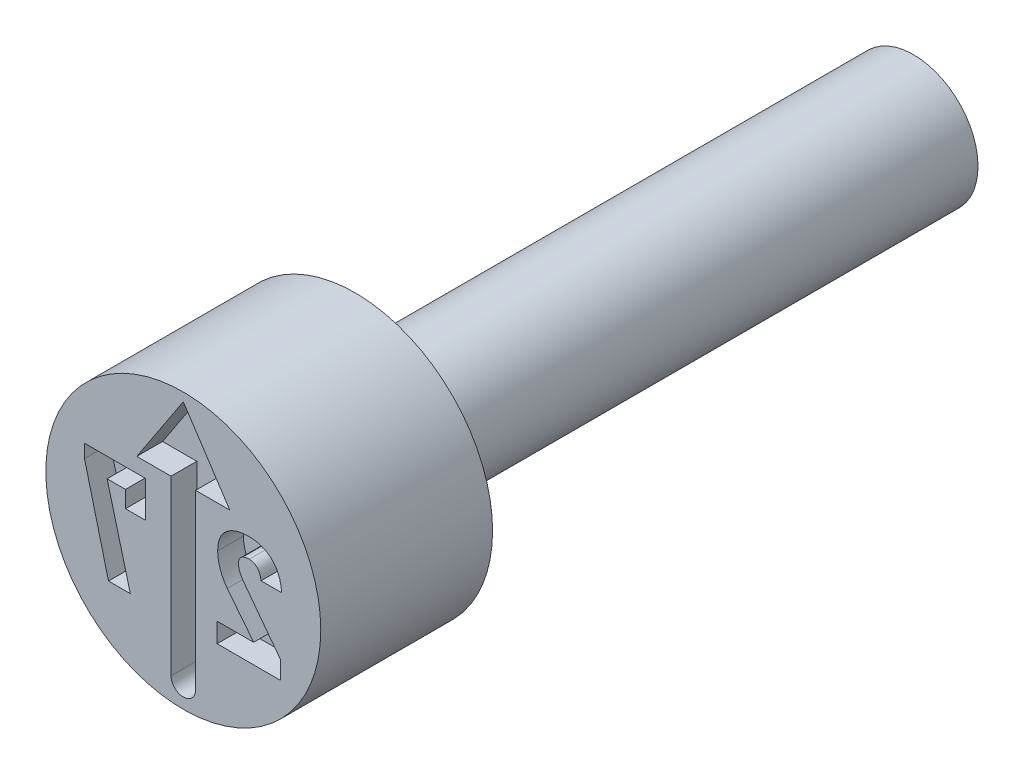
from build123d import *

# Parameters (mm, degrees)
CUT_EXTRUDE4_DEPTH = 0.6
CUT_EXTRUDE5_DEPTH = 0.6


with BuildPart() as part:
    # Sketch2 → Revolve1 (revolve)
    with BuildSketch(Plane(origin=(0, 0, 0), x_dir=(0, 0, -1), z_dir=(1, 0, 0)), mode=Mode.PRIVATE) as revolve1_sk:
        Polygon((0, 3.2), (0, 0), (17, 0), (17, 1.5), (4, 1.5), (4, 3.2), align=None)
    revolve(revolve1_sk.sketch.rotate(Axis((0, 0, -0.403888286), (0, 0, -1)), 90), axis=Axis((0, 0, -0.403888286), (0, 0, -1)))

    # Sketch3 → Cut-Extrude4 (cut)
    with BuildSketch(Plane.XY):
        with BuildLine():
            Line((0.285709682, 1.359527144), (0.285709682, -2.664242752))
            ThreePointArc((0.285709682, -2.664242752), (0, -2.949952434), (-0.285709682, -2.664242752))
            Line((-0.285709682, -2.664242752), (-0.285709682, 1.359527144))
            Line((-0.285709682, 1.359527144), (-1.082876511, 1.359527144))
            Line((-1.082876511, 1.359527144), (0, 3.00317302))
            Line((0, 3.00317302), (1.082876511, 1.359527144))
            Line((1.082876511, 1.359527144), (0.285709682, 1.359527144))
        make_face()
    extrude(amount=-CUT_EXTRUDE4_DEPTH, mode=Mode.SUBTRACT)

    # Sketch4 → Cut-Extrude5 (cut)
    with BuildSketch(Plane.XY):
        with BuildLine():
            Line((2.258882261, -1.482776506), (2.258882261, -1.057654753))
            Line((2.258882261, -1.057654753), (1.404580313, 0.074143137))
            add(Edge.make_bspline(
                [(1.404580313, 0.074143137), (1.386686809, 0.099356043), (1.351821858, 0.148482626), (1.32026639, 0.21594803), (1.30060864, 0.268841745), (1.29124019, 0.307200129), (1.284557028, 0.343797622), (1.283734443, 0.367845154), (1.283334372, 0.379540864)],
                knots=[0, 0, 0, 0, 1.664252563, 3.24274559, 3.998498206, 4.704056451, 5.369707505, 6, 6, 6, 6], degree=3))
            Line((1.283334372, 0.379540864), (1.283334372, 0.383092))
            add(Edge.make_bspline(
                [(1.283334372, 0.383092), (1.28402738, 0.399076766), (1.285355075, 0.429701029), (1.297864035, 0.472851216), (1.31836555, 0.510428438), (1.347728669, 0.5414671), (1.384283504, 0.566016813), (1.428022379, 0.583317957), (1.478373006, 0.59323906), (1.514111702, 0.594487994), (1.532928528, 0.595145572)],
                knots=[0, 0, 0, 0, 1.029992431, 1.973301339, 2.872554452, 3.768620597, 4.704316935, 5.693697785, 6.785705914, 8, 8, 8, 8], degree=3))
            add(Edge.make_bspline(
                [(1.532928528, 0.595145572), (1.551307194, 0.594428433), (1.587017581, 0.593035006), (1.637571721, 0.577591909), (1.68312593, 0.553368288), (1.722397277, 0.518804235), (1.754916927, 0.47540776), (1.78130977, 0.424304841), (1.799235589, 0.364572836), (1.805576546, 0.321814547), (1.808902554, 0.299386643)],
                knots=[0, 0, 0, 0, 0.980828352, 1.905783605, 2.800718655, 3.724477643, 4.680224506, 5.688112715, 6.78735127, 8, 8, 8, 8], degree=3))
            Line((1.808902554, 0.299386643), (1.808902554, 0.297864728))
            Line((1.808902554, 0.297864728), (2.289827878, 0.297864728))
            Line((2.289827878, 0.297864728), (2.289827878, 0.299386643))
            add(Edge.make_bspline(
                [(2.289827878, 0.299386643), (2.287454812, 0.32836516), (2.282822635, 0.384930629), (2.267636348, 0.466755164), (2.248008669, 0.54382828), (2.223039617, 0.616134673), (2.190954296, 0.682837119), (2.154905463, 0.745330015), (2.111547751, 0.801680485), (2.064086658, 0.853774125), (2.011223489, 0.899657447), (1.954856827, 0.940132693), (1.894134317, 0.973814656), (1.829979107, 1.001755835), (1.761679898, 1.022962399), (1.690128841, 1.03884773), (1.614504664, 1.048008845), (1.562884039, 1.049121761), (1.536479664, 1.049691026)],
                knots=[0, 0, 0, 0, 1.173229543, 2.290119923, 3.354877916, 4.382703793, 5.372196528, 6.339367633, 7.289741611, 8.236749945, 9.180232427, 10.11040526, 11.033485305, 11.978374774, 12.930610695, 13.916256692, 14.93414813, 16, 16, 16, 16], degree=3))
            add(Edge.make_bspline(
                [(1.536479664, 1.049691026), (1.508047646, 1.049287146), (1.452751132, 1.048501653), (1.372248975, 1.040022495), (1.296504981, 1.027224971), (1.225641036, 1.008502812), (1.159941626, 0.984081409), (1.09920994, 0.954635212), (1.043319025, 0.919913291), (0.992696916, 0.879841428), (0.947149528, 0.835147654), (0.907945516, 0.785378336), (0.874007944, 0.731539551), (0.847479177, 0.672587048), (0.825638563, 0.609907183), (0.811497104, 0.542376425), (0.80196756, 0.47078987), (0.800917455, 0.421511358), (0.800379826, 0.396281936)],
                knots=[0, 0, 0, 0, 1.219700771, 2.37215663, 3.469774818, 4.513610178, 5.512457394, 6.473141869, 7.405450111, 8.330272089, 9.238546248, 10.1372905, 11.043445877, 11.962355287, 12.905558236, 13.886315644, 14.917844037, 16, 16, 16, 16], degree=3))
            Line((0.800379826, 0.396281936), (0.800379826, 0.394252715))
            add(Edge.make_bspline(
                [(0.800379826, 0.394252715), (0.801026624, 0.365807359), (0.802321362, 0.308866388), (0.81400845, 0.223646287), (0.832841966, 0.138861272), (0.858707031, 0.054920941), (0.890838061, -0.026720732), (0.929401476, -0.104945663), (0.972925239, -0.179788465), (1.007413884, -0.22598052), (1.024608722, -0.249010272)],
                knots=[0, 0, 0, 0, 0.984368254, 1.970475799, 2.971844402, 3.988480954, 5.008197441, 6.005725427, 7.005724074, 8, 8, 8, 8], degree=3))
            Line((1.024608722, -0.249010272), (1.637433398, -1.028231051))
            Line((1.637433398, -1.028231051), (0.786682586, -1.028231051))
            Line((0.786682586, -1.028231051), (0.786682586, -1.482776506))
            Line((0.786682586, -1.482776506), (2.258882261, -1.482776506))
        make_face()
        Polygon((-2.29921433, 1.017223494), (-2.29921433, 0.703708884), (-1.741178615, -1.482776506), (-1.23285881, -1.482776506), (-1.773646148, 0.562678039), (-1.345987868, 0.562678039), (-1.345987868, 0.17306765), (-0.876730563, 0.17306765), (-0.876730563, 1.017223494), align=None)
    extrude(amount=-CUT_EXTRUDE5_DEPTH, mode=Mode.SUBTRACT)


solid = part.part
